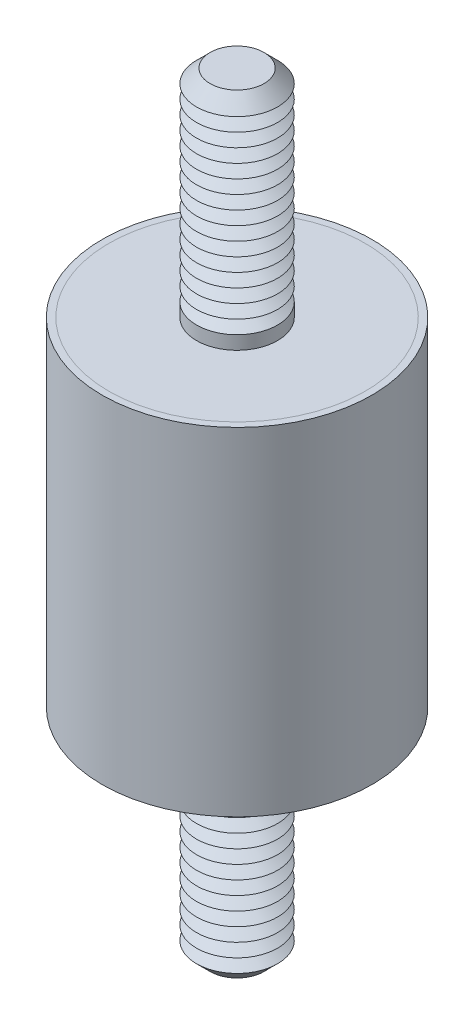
ISO-10303-21;
HEADER;
FILE_DESCRIPTION(('STEP AP214'),'2;1');
FILE_NAME('part.step','',(''),(''),'','','');
FILE_SCHEMA(('AUTOMOTIVE_DESIGN { 1 0 10303 214 1 1 1 1 }'));
ENDSEC;
DATA;
#1=APPLICATION_CONTEXT('core data for automotive mechanical design processes');
#2=APPLICATION_PROTOCOL_DEFINITION('international standard','automotive_design',2000,#1);
#3=PRODUCT_CONTEXT('',#1,'mechanical');
#4=PRODUCT('Part','Part','',(#3));
#5=PRODUCT_RELATED_PRODUCT_CATEGORY('part','',(#4));
#6=PRODUCT_DEFINITION_FORMATION('','',#4);
#7=PRODUCT_DEFINITION_CONTEXT('part definition',#1,'design');
#8=PRODUCT_DEFINITION('design','',#6,#7);
#9=PRODUCT_DEFINITION_SHAPE('','',#8);
#10=(LENGTH_UNIT() NAMED_UNIT(*) SI_UNIT(.MILLI.,.METRE.));
#11=(NAMED_UNIT(*) PLANE_ANGLE_UNIT() SI_UNIT($,.RADIAN.));
#12=(NAMED_UNIT(*) SI_UNIT($,.STERADIAN.) SOLID_ANGLE_UNIT());
#13=UNCERTAINTY_MEASURE_WITH_UNIT(LENGTH_MEASURE(1.E-05),#10,'distance_accuracy_value','');
#14=(GEOMETRIC_REPRESENTATION_CONTEXT(3) GLOBAL_UNCERTAINTY_ASSIGNED_CONTEXT((#13)) GLOBAL_UNIT_ASSIGNED_CONTEXT((#10,
#11,#12)) REPRESENTATION_CONTEXT('',''));
#15=CARTESIAN_POINT('',(0.,0.,0.));
#16=DIRECTION('',(0.,0.,1.));
#17=DIRECTION('',(1.,0.,0.));
#18=AXIS2_PLACEMENT_3D('',#15,#16,#17);
#19=CARTESIAN_POINT('',(0.,-28.5,0.));
#20=DIRECTION('',(0.,1.,0.));
#21=DIRECTION('',(0.,0.,1.));
#22=AXIS2_PLACEMENT_3D('',#19,#20,#21);
#23=CYLINDRICAL_SURFACE('',#22,3.);
#24=CARTESIAN_POINT('',(0.,-12.5,0.));
#25=DIRECTION('',(0.,-1.,0.));
#26=DIRECTION('',(0.,0.,-1.));
#27=AXIS2_PLACEMENT_3D('',#24,#25,#26);
#28=CIRCLE('',#27,3.);
#29=CARTESIAN_POINT('',(0.,-12.5,-3.));
#30=VERTEX_POINT('',#29);
#31=EDGE_CURVE('P0_E21',#30,#30,#28,.T.);
#32=ORIENTED_EDGE('',*,*,#31,.T.);
#33=EDGE_LOOP('',(#32));
#34=FACE_BOUND('',#33,.T.);
#35=CARTESIAN_POINT('',(0.,-13.5,0.));
#36=DIRECTION('',(0.,1.,0.));
#37=DIRECTION('',(0.,0.,1.));
#38=AXIS2_PLACEMENT_3D('',#35,#36,#37);
#39=CIRCLE('',#38,3.);
#40=CARTESIAN_POINT('',(0.,-13.5,3.));
#41=VERTEX_POINT('',#40);
#42=EDGE_CURVE('P0_E33',#41,#41,#39,.T.);
#43=ORIENTED_EDGE('',*,*,#42,.T.);
#44=EDGE_LOOP('',(#43));
#45=FACE_BOUND('',#44,.T.);
#46=ADVANCED_FACE('P0_F14',(#34,#45),#23,.T.);
#47=CARTESIAN_POINT('',(0.,-12.5,0.));
#48=DIRECTION('',(0.,1.,0.));
#49=DIRECTION('',(0.,0.,1.));
#50=AXIS2_PLACEMENT_3D('',#47,#48,#49);
#51=CYLINDRICAL_SURFACE('',#50,9.5);
#52=CARTESIAN_POINT('',(0.,-12.5,0.));
#53=DIRECTION('',(0.,1.,0.));
#54=DIRECTION('',(0.,0.,1.));
#55=AXIS2_PLACEMENT_3D('',#52,#53,#54);
#56=CIRCLE('',#55,9.5);
#57=CARTESIAN_POINT('',(0.,-12.5,9.5));
#58=VERTEX_POINT('',#57);
#59=EDGE_CURVE('P0_E25',#58,#58,#56,.T.);
#60=ORIENTED_EDGE('',*,*,#59,.T.);
#61=EDGE_LOOP('',(#60));
#62=FACE_BOUND('',#61,.T.);
#63=CARTESIAN_POINT('',(0.,-11.5,0.));
#64=DIRECTION('',(0.,1.,0.));
#65=DIRECTION('',(0.,0.,1.));
#66=AXIS2_PLACEMENT_3D('',#63,#64,#65);
#67=CIRCLE('',#66,9.5);
#68=CARTESIAN_POINT('',(0.,-11.5,9.5));
#69=VERTEX_POINT('',#68);
#70=EDGE_CURVE('P0_E30',#69,#69,#67,.T.);
#71=ORIENTED_EDGE('',*,*,#70,.F.);
#72=EDGE_LOOP('',(#71));
#73=FACE_BOUND('',#72,.T.);
#74=ADVANCED_FACE('P0_F145',(#62,#73),#51,.T.);
#75=CARTESIAN_POINT('',(0.,-12.5,0.));
#76=DIRECTION('',(0.,1.,0.));
#77=DIRECTION('',(0.,0.,1.));
#78=AXIS2_PLACEMENT_3D('',#75,#76,#77);
#79=PLANE('',#78);
#80=ORIENTED_EDGE('',*,*,#31,.F.);
#81=EDGE_LOOP('',(#80));
#82=FACE_BOUND('',#81,.T.);
#83=ORIENTED_EDGE('',*,*,#59,.F.);
#84=EDGE_LOOP('',(#83));
#85=FACE_BOUND('',#84,.T.);
#86=ADVANCED_FACE('P0_F150',(#82,#85),#79,.F.);
#87=CARTESIAN_POINT('',(0.,-11.5,0.));
#88=DIRECTION('',(0.,1.,0.));
#89=DIRECTION('',(0.,0.,1.));
#90=AXIS2_PLACEMENT_3D('',#87,#88,#89);
#91=PLANE('',#90);
#92=ORIENTED_EDGE('',*,*,#70,.T.);
#93=EDGE_LOOP('',(#92));
#94=FACE_BOUND('',#93,.T.);
#95=ADVANCED_FACE('P0_F156',(#94),#91,.T.);
#96=CARTESIAN_POINT('',(0.,-13.5,0.));
#97=DIRECTION('',(0.,1.,0.));
#98=DIRECTION('',(0.,0.,1.));
#99=AXIS2_PLACEMENT_3D('',#96,#97,#98);
#100=CONICAL_SURFACE('',#99,3.,1.0471975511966);
#101=CARTESIAN_POINT('',(0.,-14.,0.));
#102=DIRECTION('',(0.,1.,0.));
#103=DIRECTION('',(0.,0.,1.));
#104=AXIS2_PLACEMENT_3D('',#101,#102,#103);
#105=CIRCLE('',#104,2.13397459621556);
#106=CARTESIAN_POINT('',(0.,-14.,2.13397459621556));
#107=VERTEX_POINT('',#106);
#108=EDGE_CURVE('P0_E39',#107,#107,#105,.T.);
#109=ORIENTED_EDGE('',*,*,#108,.T.);
#110=EDGE_LOOP('',(#109));
#111=FACE_BOUND('',#110,.T.);
#112=ORIENTED_EDGE('',*,*,#42,.F.);
#113=EDGE_LOOP('',(#112));
#114=FACE_BOUND('',#113,.T.);
#115=ADVANCED_FACE('P0_F159',(#111,#114),#100,.T.);
#116=CARTESIAN_POINT('',(0.,-14.,0.));
#117=DIRECTION('',(0.,-1.,0.));
#118=DIRECTION('',(0.,0.,-1.));
#119=AXIS2_PLACEMENT_3D('',#116,#117,#118);
#120=CONICAL_SURFACE('',#119,2.13397459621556,1.0471975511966);
#121=CARTESIAN_POINT('',(0.,-14.5,0.));
#122=DIRECTION('',(0.,1.,0.));
#123=DIRECTION('',(0.,0.,1.));
#124=AXIS2_PLACEMENT_3D('',#121,#122,#123);
#125=CIRCLE('',#124,3.);
#126=CARTESIAN_POINT('',(0.,-14.5,3.));
#127=VERTEX_POINT('',#126);
#128=EDGE_CURVE('P0_E43',#127,#127,#125,.T.);
#129=ORIENTED_EDGE('',*,*,#128,.T.);
#130=EDGE_LOOP('',(#129));
#131=FACE_BOUND('',#130,.T.);
#132=ORIENTED_EDGE('',*,*,#108,.F.);
#133=EDGE_LOOP('',(#132));
#134=FACE_BOUND('',#133,.T.);
#135=ADVANCED_FACE('P0_F163',(#131,#134),#120,.T.);
#136=CARTESIAN_POINT('',(0.,-14.5,0.));
#137=DIRECTION('',(0.,1.,0.));
#138=DIRECTION('',(0.,0.,1.));
#139=AXIS2_PLACEMENT_3D('',#136,#137,#138);
#140=CONICAL_SURFACE('',#139,3.,1.0471975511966);
#141=CARTESIAN_POINT('',(0.,-15.,0.));
#142=DIRECTION('',(0.,1.,0.));
#143=DIRECTION('',(0.,0.,1.));
#144=AXIS2_PLACEMENT_3D('',#141,#142,#143);
#145=CIRCLE('',#144,2.13397459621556);
#146=CARTESIAN_POINT('',(0.,-15.,2.13397459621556));
#147=VERTEX_POINT('',#146);
#148=EDGE_CURVE('P0_E47',#147,#147,#145,.T.);
#149=ORIENTED_EDGE('',*,*,#148,.T.);
#150=EDGE_LOOP('',(#149));
#151=FACE_BOUND('',#150,.T.);
#152=ORIENTED_EDGE('',*,*,#128,.F.);
#153=EDGE_LOOP('',(#152));
#154=FACE_BOUND('',#153,.T.);
#155=ADVANCED_FACE('P0_F167',(#151,#154),#140,.T.);
#156=CARTESIAN_POINT('',(0.,-15.,0.));
#157=DIRECTION('',(0.,-1.,0.));
#158=DIRECTION('',(0.,0.,-1.));
#159=AXIS2_PLACEMENT_3D('',#156,#157,#158);
#160=CONICAL_SURFACE('',#159,2.13397459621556,1.0471975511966);
#161=CARTESIAN_POINT('',(0.,-15.5,0.));
#162=DIRECTION('',(0.,1.,0.));
#163=DIRECTION('',(0.,0.,1.));
#164=AXIS2_PLACEMENT_3D('',#161,#162,#163);
#165=CIRCLE('',#164,3.);
#166=CARTESIAN_POINT('',(0.,-15.5,3.));
#167=VERTEX_POINT('',#166);
#168=EDGE_CURVE('P0_E52',#167,#167,#165,.T.);
#169=ORIENTED_EDGE('',*,*,#168,.T.);
#170=EDGE_LOOP('',(#169));
#171=FACE_BOUND('',#170,.T.);
#172=ORIENTED_EDGE('',*,*,#148,.F.);
#173=EDGE_LOOP('',(#172));
#174=FACE_BOUND('',#173,.T.);
#175=ADVANCED_FACE('P0_F174',(#171,#174),#160,.T.);
#176=CARTESIAN_POINT('',(0.,-15.5,0.));
#177=DIRECTION('',(0.,1.,0.));
#178=DIRECTION('',(0.,0.,1.));
#179=AXIS2_PLACEMENT_3D('',#176,#177,#178);
#180=CONICAL_SURFACE('',#179,3.,1.0471975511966);
#181=CARTESIAN_POINT('',(0.,-16.,0.));
#182=DIRECTION('',(0.,1.,0.));
#183=DIRECTION('',(0.,0.,1.));
#184=AXIS2_PLACEMENT_3D('',#181,#182,#183);
#185=CIRCLE('',#184,2.13397459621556);
#186=CARTESIAN_POINT('',(0.,-16.,2.13397459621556));
#187=VERTEX_POINT('',#186);
#188=EDGE_CURVE('P0_E55',#187,#187,#185,.T.);
#189=ORIENTED_EDGE('',*,*,#188,.T.);
#190=EDGE_LOOP('',(#189));
#191=FACE_BOUND('',#190,.T.);
#192=ORIENTED_EDGE('',*,*,#168,.F.);
#193=EDGE_LOOP('',(#192));
#194=FACE_BOUND('',#193,.T.);
#195=ADVANCED_FACE('P0_F178',(#191,#194),#180,.T.);
#196=CARTESIAN_POINT('',(0.,-16.,0.));
#197=DIRECTION('',(0.,-1.,0.));
#198=DIRECTION('',(0.,0.,-1.));
#199=AXIS2_PLACEMENT_3D('',#196,#197,#198);
#200=CONICAL_SURFACE('',#199,2.13397459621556,1.0471975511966);
#201=CARTESIAN_POINT('',(0.,-16.5,0.));
#202=DIRECTION('',(0.,1.,0.));
#203=DIRECTION('',(0.,0.,1.));
#204=AXIS2_PLACEMENT_3D('',#201,#202,#203);
#205=CIRCLE('',#204,3.);
#206=CARTESIAN_POINT('',(0.,-16.5,3.));
#207=VERTEX_POINT('',#206);
#208=EDGE_CURVE('P0_E58',#207,#207,#205,.T.);
#209=ORIENTED_EDGE('',*,*,#208,.T.);
#210=EDGE_LOOP('',(#209));
#211=FACE_BOUND('',#210,.T.);
#212=ORIENTED_EDGE('',*,*,#188,.F.);
#213=EDGE_LOOP('',(#212));
#214=FACE_BOUND('',#213,.T.);
#215=ADVANCED_FACE('P0_F182',(#211,#214),#200,.T.);
#216=CARTESIAN_POINT('',(0.,-16.5,0.));
#217=DIRECTION('',(0.,1.,0.));
#218=DIRECTION('',(0.,0.,1.));
#219=AXIS2_PLACEMENT_3D('',#216,#217,#218);
#220=CONICAL_SURFACE('',#219,3.,1.0471975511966);
#221=CARTESIAN_POINT('',(0.,-17.,0.));
#222=DIRECTION('',(0.,1.,0.));
#223=DIRECTION('',(0.,0.,1.));
#224=AXIS2_PLACEMENT_3D('',#221,#222,#223);
#225=CIRCLE('',#224,2.13397459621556);
#226=CARTESIAN_POINT('',(0.,-17.,2.13397459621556));
#227=VERTEX_POINT('',#226);
#228=EDGE_CURVE('P0_E61',#227,#227,#225,.T.);
#229=ORIENTED_EDGE('',*,*,#228,.T.);
#230=EDGE_LOOP('',(#229));
#231=FACE_BOUND('',#230,.T.);
#232=ORIENTED_EDGE('',*,*,#208,.F.);
#233=EDGE_LOOP('',(#232));
#234=FACE_BOUND('',#233,.T.);
#235=ADVANCED_FACE('P0_F186',(#231,#234),#220,.T.);
#236=CARTESIAN_POINT('',(0.,-17.,0.));
#237=DIRECTION('',(0.,-1.,0.));
#238=DIRECTION('',(0.,0.,-1.));
#239=AXIS2_PLACEMENT_3D('',#236,#237,#238);
#240=CONICAL_SURFACE('',#239,2.13397459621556,1.0471975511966);
#241=CARTESIAN_POINT('',(0.,-17.5,0.));
#242=DIRECTION('',(0.,1.,0.));
#243=DIRECTION('',(0.,0.,1.));
#244=AXIS2_PLACEMENT_3D('',#241,#242,#243);
#245=CIRCLE('',#244,3.);
#246=CARTESIAN_POINT('',(0.,-17.5,3.));
#247=VERTEX_POINT('',#246);
#248=EDGE_CURVE('P0_E64',#247,#247,#245,.T.);
#249=ORIENTED_EDGE('',*,*,#248,.T.);
#250=EDGE_LOOP('',(#249));
#251=FACE_BOUND('',#250,.T.);
#252=ORIENTED_EDGE('',*,*,#228,.F.);
#253=EDGE_LOOP('',(#252));
#254=FACE_BOUND('',#253,.T.);
#255=ADVANCED_FACE('P0_F190',(#251,#254),#240,.T.);
#256=CARTESIAN_POINT('',(0.,-17.5,0.));
#257=DIRECTION('',(0.,1.,0.));
#258=DIRECTION('',(0.,0.,1.));
#259=AXIS2_PLACEMENT_3D('',#256,#257,#258);
#260=CONICAL_SURFACE('',#259,3.,1.0471975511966);
#261=CARTESIAN_POINT('',(0.,-18.,0.));
#262=DIRECTION('',(0.,1.,0.));
#263=DIRECTION('',(0.,0.,1.));
#264=AXIS2_PLACEMENT_3D('',#261,#262,#263);
#265=CIRCLE('',#264,2.13397459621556);
#266=CARTESIAN_POINT('',(0.,-18.,2.13397459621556));
#267=VERTEX_POINT('',#266);
#268=EDGE_CURVE('P0_E67',#267,#267,#265,.T.);
#269=ORIENTED_EDGE('',*,*,#268,.T.);
#270=EDGE_LOOP('',(#269));
#271=FACE_BOUND('',#270,.T.);
#272=ORIENTED_EDGE('',*,*,#248,.F.);
#273=EDGE_LOOP('',(#272));
#274=FACE_BOUND('',#273,.T.);
#275=ADVANCED_FACE('P0_F194',(#271,#274),#260,.T.);
#276=CARTESIAN_POINT('',(0.,-18.,0.));
#277=DIRECTION('',(0.,-1.,0.));
#278=DIRECTION('',(0.,0.,-1.));
#279=AXIS2_PLACEMENT_3D('',#276,#277,#278);
#280=CONICAL_SURFACE('',#279,2.13397459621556,1.0471975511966);
#281=CARTESIAN_POINT('',(0.,-18.5,0.));
#282=DIRECTION('',(0.,1.,0.));
#283=DIRECTION('',(0.,0.,1.));
#284=AXIS2_PLACEMENT_3D('',#281,#282,#283);
#285=CIRCLE('',#284,3.);
#286=CARTESIAN_POINT('',(0.,-18.5,3.));
#287=VERTEX_POINT('',#286);
#288=EDGE_CURVE('P0_E70',#287,#287,#285,.T.);
#289=ORIENTED_EDGE('',*,*,#288,.T.);
#290=EDGE_LOOP('',(#289));
#291=FACE_BOUND('',#290,.T.);
#292=ORIENTED_EDGE('',*,*,#268,.F.);
#293=EDGE_LOOP('',(#292));
#294=FACE_BOUND('',#293,.T.);
#295=ADVANCED_FACE('P0_F198',(#291,#294),#280,.T.);
#296=CARTESIAN_POINT('',(0.,-18.5,0.));
#297=DIRECTION('',(0.,1.,0.));
#298=DIRECTION('',(0.,0.,1.));
#299=AXIS2_PLACEMENT_3D('',#296,#297,#298);
#300=CONICAL_SURFACE('',#299,3.,1.0471975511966);
#301=CARTESIAN_POINT('',(0.,-19.,0.));
#302=DIRECTION('',(0.,1.,0.));
#303=DIRECTION('',(0.,0.,1.));
#304=AXIS2_PLACEMENT_3D('',#301,#302,#303);
#305=CIRCLE('',#304,2.13397459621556);
#306=CARTESIAN_POINT('',(0.,-19.,2.13397459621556));
#307=VERTEX_POINT('',#306);
#308=EDGE_CURVE('P0_E73',#307,#307,#305,.T.);
#309=ORIENTED_EDGE('',*,*,#308,.T.);
#310=EDGE_LOOP('',(#309));
#311=FACE_BOUND('',#310,.T.);
#312=ORIENTED_EDGE('',*,*,#288,.F.);
#313=EDGE_LOOP('',(#312));
#314=FACE_BOUND('',#313,.T.);
#315=ADVANCED_FACE('P0_F202',(#311,#314),#300,.T.);
#316=CARTESIAN_POINT('',(0.,-19.,0.));
#317=DIRECTION('',(0.,-1.,0.));
#318=DIRECTION('',(0.,0.,-1.));
#319=AXIS2_PLACEMENT_3D('',#316,#317,#318);
#320=CONICAL_SURFACE('',#319,2.13397459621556,1.0471975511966);
#321=CARTESIAN_POINT('',(0.,-19.5,0.));
#322=DIRECTION('',(0.,1.,0.));
#323=DIRECTION('',(0.,0.,1.));
#324=AXIS2_PLACEMENT_3D('',#321,#322,#323);
#325=CIRCLE('',#324,3.);
#326=CARTESIAN_POINT('',(0.,-19.5,3.));
#327=VERTEX_POINT('',#326);
#328=EDGE_CURVE('P0_E76',#327,#327,#325,.T.);
#329=ORIENTED_EDGE('',*,*,#328,.T.);
#330=EDGE_LOOP('',(#329));
#331=FACE_BOUND('',#330,.T.);
#332=ORIENTED_EDGE('',*,*,#308,.F.);
#333=EDGE_LOOP('',(#332));
#334=FACE_BOUND('',#333,.T.);
#335=ADVANCED_FACE('P0_F206',(#331,#334),#320,.T.);
#336=CARTESIAN_POINT('',(0.,-19.5,0.));
#337=DIRECTION('',(0.,1.,0.));
#338=DIRECTION('',(0.,0.,1.));
#339=AXIS2_PLACEMENT_3D('',#336,#337,#338);
#340=CONICAL_SURFACE('',#339,3.,1.0471975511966);
#341=CARTESIAN_POINT('',(0.,-20.,0.));
#342=DIRECTION('',(0.,1.,0.));
#343=DIRECTION('',(0.,0.,1.));
#344=AXIS2_PLACEMENT_3D('',#341,#342,#343);
#345=CIRCLE('',#344,2.13397459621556);
#346=CARTESIAN_POINT('',(0.,-20.,2.13397459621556));
#347=VERTEX_POINT('',#346);
#348=EDGE_CURVE('P0_E79',#347,#347,#345,.T.);
#349=ORIENTED_EDGE('',*,*,#348,.T.);
#350=EDGE_LOOP('',(#349));
#351=FACE_BOUND('',#350,.T.);
#352=ORIENTED_EDGE('',*,*,#328,.F.);
#353=EDGE_LOOP('',(#352));
#354=FACE_BOUND('',#353,.T.);
#355=ADVANCED_FACE('P0_F210',(#351,#354),#340,.T.);
#356=CARTESIAN_POINT('',(0.,-20.,0.));
#357=DIRECTION('',(0.,-1.,0.));
#358=DIRECTION('',(0.,0.,-1.));
#359=AXIS2_PLACEMENT_3D('',#356,#357,#358);
#360=CONICAL_SURFACE('',#359,2.13397459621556,1.0471975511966);
#361=CARTESIAN_POINT('',(0.,-20.5,0.));
#362=DIRECTION('',(0.,1.,0.));
#363=DIRECTION('',(0.,0.,1.));
#364=AXIS2_PLACEMENT_3D('',#361,#362,#363);
#365=CIRCLE('',#364,3.);
#366=CARTESIAN_POINT('',(0.,-20.5,3.));
#367=VERTEX_POINT('',#366);
#368=EDGE_CURVE('P0_E82',#367,#367,#365,.T.);
#369=ORIENTED_EDGE('',*,*,#368,.T.);
#370=EDGE_LOOP('',(#369));
#371=FACE_BOUND('',#370,.T.);
#372=ORIENTED_EDGE('',*,*,#348,.F.);
#373=EDGE_LOOP('',(#372));
#374=FACE_BOUND('',#373,.T.);
#375=ADVANCED_FACE('P0_F214',(#371,#374),#360,.T.);
#376=CARTESIAN_POINT('',(0.,-20.5,0.));
#377=DIRECTION('',(0.,1.,0.));
#378=DIRECTION('',(0.,0.,1.));
#379=AXIS2_PLACEMENT_3D('',#376,#377,#378);
#380=CONICAL_SURFACE('',#379,3.,1.0471975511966);
#381=CARTESIAN_POINT('',(0.,-21.,0.));
#382=DIRECTION('',(0.,1.,0.));
#383=DIRECTION('',(0.,0.,1.));
#384=AXIS2_PLACEMENT_3D('',#381,#382,#383);
#385=CIRCLE('',#384,2.13397459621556);
#386=CARTESIAN_POINT('',(0.,-21.,2.13397459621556));
#387=VERTEX_POINT('',#386);
#388=EDGE_CURVE('P0_E85',#387,#387,#385,.T.);
#389=ORIENTED_EDGE('',*,*,#388,.T.);
#390=EDGE_LOOP('',(#389));
#391=FACE_BOUND('',#390,.T.);
#392=ORIENTED_EDGE('',*,*,#368,.F.);
#393=EDGE_LOOP('',(#392));
#394=FACE_BOUND('',#393,.T.);
#395=ADVANCED_FACE('P0_F218',(#391,#394),#380,.T.);
#396=CARTESIAN_POINT('',(0.,-21.,0.));
#397=DIRECTION('',(0.,-1.,0.));
#398=DIRECTION('',(0.,0.,-1.));
#399=AXIS2_PLACEMENT_3D('',#396,#397,#398);
#400=CONICAL_SURFACE('',#399,2.13397459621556,1.0471975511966);
#401=CARTESIAN_POINT('',(0.,-21.5,0.));
#402=DIRECTION('',(0.,1.,0.));
#403=DIRECTION('',(0.,0.,1.));
#404=AXIS2_PLACEMENT_3D('',#401,#402,#403);
#405=CIRCLE('',#404,3.);
#406=CARTESIAN_POINT('',(0.,-21.5,3.));
#407=VERTEX_POINT('',#406);
#408=EDGE_CURVE('P0_E88',#407,#407,#405,.T.);
#409=ORIENTED_EDGE('',*,*,#408,.T.);
#410=EDGE_LOOP('',(#409));
#411=FACE_BOUND('',#410,.T.);
#412=ORIENTED_EDGE('',*,*,#388,.F.);
#413=EDGE_LOOP('',(#412));
#414=FACE_BOUND('',#413,.T.);
#415=ADVANCED_FACE('P0_F222',(#411,#414),#400,.T.);
#416=CARTESIAN_POINT('',(0.,-21.5,0.));
#417=DIRECTION('',(0.,1.,0.));
#418=DIRECTION('',(0.,0.,1.));
#419=AXIS2_PLACEMENT_3D('',#416,#417,#418);
#420=CONICAL_SURFACE('',#419,3.,1.0471975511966);
#421=CARTESIAN_POINT('',(0.,-22.,0.));
#422=DIRECTION('',(0.,1.,0.));
#423=DIRECTION('',(0.,0.,1.));
#424=AXIS2_PLACEMENT_3D('',#421,#422,#423);
#425=CIRCLE('',#424,2.13397459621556);
#426=CARTESIAN_POINT('',(0.,-22.,2.13397459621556));
#427=VERTEX_POINT('',#426);
#428=EDGE_CURVE('P0_E91',#427,#427,#425,.T.);
#429=ORIENTED_EDGE('',*,*,#428,.T.);
#430=EDGE_LOOP('',(#429));
#431=FACE_BOUND('',#430,.T.);
#432=ORIENTED_EDGE('',*,*,#408,.F.);
#433=EDGE_LOOP('',(#432));
#434=FACE_BOUND('',#433,.T.);
#435=ADVANCED_FACE('P0_F226',(#431,#434),#420,.T.);
#436=CARTESIAN_POINT('',(0.,-22.,0.));
#437=DIRECTION('',(0.,-1.,0.));
#438=DIRECTION('',(0.,0.,-1.));
#439=AXIS2_PLACEMENT_3D('',#436,#437,#438);
#440=CONICAL_SURFACE('',#439,2.13397459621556,1.0471975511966);
#441=CARTESIAN_POINT('',(0.,-22.5,0.));
#442=DIRECTION('',(0.,1.,0.));
#443=DIRECTION('',(0.,0.,1.));
#444=AXIS2_PLACEMENT_3D('',#441,#442,#443);
#445=CIRCLE('',#444,3.);
#446=CARTESIAN_POINT('',(0.,-22.5,3.));
#447=VERTEX_POINT('',#446);
#448=EDGE_CURVE('P0_E94',#447,#447,#445,.T.);
#449=ORIENTED_EDGE('',*,*,#448,.T.);
#450=EDGE_LOOP('',(#449));
#451=FACE_BOUND('',#450,.T.);
#452=ORIENTED_EDGE('',*,*,#428,.F.);
#453=EDGE_LOOP('',(#452));
#454=FACE_BOUND('',#453,.T.);
#455=ADVANCED_FACE('P0_F230',(#451,#454),#440,.T.);
#456=CARTESIAN_POINT('',(0.,-22.5,0.));
#457=DIRECTION('',(0.,1.,0.));
#458=DIRECTION('',(0.,0.,1.));
#459=AXIS2_PLACEMENT_3D('',#456,#457,#458);
#460=CONICAL_SURFACE('',#459,3.,1.0471975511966);
#461=CARTESIAN_POINT('',(0.,-23.,0.));
#462=DIRECTION('',(0.,1.,0.));
#463=DIRECTION('',(0.,0.,1.));
#464=AXIS2_PLACEMENT_3D('',#461,#462,#463);
#465=CIRCLE('',#464,2.13397459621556);
#466=CARTESIAN_POINT('',(0.,-23.,2.13397459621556));
#467=VERTEX_POINT('',#466);
#468=EDGE_CURVE('P0_E97',#467,#467,#465,.T.);
#469=ORIENTED_EDGE('',*,*,#468,.T.);
#470=EDGE_LOOP('',(#469));
#471=FACE_BOUND('',#470,.T.);
#472=ORIENTED_EDGE('',*,*,#448,.F.);
#473=EDGE_LOOP('',(#472));
#474=FACE_BOUND('',#473,.T.);
#475=ADVANCED_FACE('P0_F234',(#471,#474),#460,.T.);
#476=CARTESIAN_POINT('',(0.,-23.,0.));
#477=DIRECTION('',(0.,-1.,0.));
#478=DIRECTION('',(0.,0.,-1.));
#479=AXIS2_PLACEMENT_3D('',#476,#477,#478);
#480=CONICAL_SURFACE('',#479,2.13397459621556,1.0471975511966);
#481=CARTESIAN_POINT('',(0.,-23.5,0.));
#482=DIRECTION('',(0.,1.,0.));
#483=DIRECTION('',(0.,0.,1.));
#484=AXIS2_PLACEMENT_3D('',#481,#482,#483);
#485=CIRCLE('',#484,3.);
#486=CARTESIAN_POINT('',(0.,-23.5,3.));
#487=VERTEX_POINT('',#486);
#488=EDGE_CURVE('P0_E100',#487,#487,#485,.T.);
#489=ORIENTED_EDGE('',*,*,#488,.T.);
#490=EDGE_LOOP('',(#489));
#491=FACE_BOUND('',#490,.T.);
#492=ORIENTED_EDGE('',*,*,#468,.F.);
#493=EDGE_LOOP('',(#492));
#494=FACE_BOUND('',#493,.T.);
#495=ADVANCED_FACE('P0_F238',(#491,#494),#480,.T.);
#496=CARTESIAN_POINT('',(0.,-23.5,0.));
#497=DIRECTION('',(0.,1.,0.));
#498=DIRECTION('',(0.,0.,1.));
#499=AXIS2_PLACEMENT_3D('',#496,#497,#498);
#500=CONICAL_SURFACE('',#499,3.,1.0471975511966);
#501=CARTESIAN_POINT('',(0.,-24.,0.));
#502=DIRECTION('',(0.,1.,0.));
#503=DIRECTION('',(0.,0.,1.));
#504=AXIS2_PLACEMENT_3D('',#501,#502,#503);
#505=CIRCLE('',#504,2.13397459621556);
#506=CARTESIAN_POINT('',(0.,-24.,2.13397459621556));
#507=VERTEX_POINT('',#506);
#508=EDGE_CURVE('P0_E103',#507,#507,#505,.T.);
#509=ORIENTED_EDGE('',*,*,#508,.T.);
#510=EDGE_LOOP('',(#509));
#511=FACE_BOUND('',#510,.T.);
#512=ORIENTED_EDGE('',*,*,#488,.F.);
#513=EDGE_LOOP('',(#512));
#514=FACE_BOUND('',#513,.T.);
#515=ADVANCED_FACE('P0_F242',(#511,#514),#500,.T.);
#516=CARTESIAN_POINT('',(0.,-24.,0.));
#517=DIRECTION('',(0.,-1.,0.));
#518=DIRECTION('',(0.,0.,-1.));
#519=AXIS2_PLACEMENT_3D('',#516,#517,#518);
#520=CONICAL_SURFACE('',#519,2.13397459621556,1.0471975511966);
#521=CARTESIAN_POINT('',(0.,-24.5,0.));
#522=DIRECTION('',(0.,1.,0.));
#523=DIRECTION('',(0.,0.,1.));
#524=AXIS2_PLACEMENT_3D('',#521,#522,#523);
#525=CIRCLE('',#524,3.);
#526=CARTESIAN_POINT('',(0.,-24.5,3.));
#527=VERTEX_POINT('',#526);
#528=EDGE_CURVE('P0_E106',#527,#527,#525,.T.);
#529=ORIENTED_EDGE('',*,*,#528,.T.);
#530=EDGE_LOOP('',(#529));
#531=FACE_BOUND('',#530,.T.);
#532=ORIENTED_EDGE('',*,*,#508,.F.);
#533=EDGE_LOOP('',(#532));
#534=FACE_BOUND('',#533,.T.);
#535=ADVANCED_FACE('P0_F246',(#531,#534),#520,.T.);
#536=CARTESIAN_POINT('',(0.,-24.5,0.));
#537=DIRECTION('',(0.,1.,0.));
#538=DIRECTION('',(0.,0.,1.));
#539=AXIS2_PLACEMENT_3D('',#536,#537,#538);
#540=CONICAL_SURFACE('',#539,3.,1.0471975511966);
#541=CARTESIAN_POINT('',(0.,-25.,0.));
#542=DIRECTION('',(0.,1.,0.));
#543=DIRECTION('',(0.,0.,1.));
#544=AXIS2_PLACEMENT_3D('',#541,#542,#543);
#545=CIRCLE('',#544,2.13397459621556);
#546=CARTESIAN_POINT('',(0.,-25.,2.13397459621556));
#547=VERTEX_POINT('',#546);
#548=EDGE_CURVE('P0_E109',#547,#547,#545,.T.);
#549=ORIENTED_EDGE('',*,*,#548,.T.);
#550=EDGE_LOOP('',(#549));
#551=FACE_BOUND('',#550,.T.);
#552=ORIENTED_EDGE('',*,*,#528,.F.);
#553=EDGE_LOOP('',(#552));
#554=FACE_BOUND('',#553,.T.);
#555=ADVANCED_FACE('P0_F250',(#551,#554),#540,.T.);
#556=CARTESIAN_POINT('',(0.,-25.,0.));
#557=DIRECTION('',(0.,-1.,0.));
#558=DIRECTION('',(0.,0.,-1.));
#559=AXIS2_PLACEMENT_3D('',#556,#557,#558);
#560=CONICAL_SURFACE('',#559,2.13397459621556,1.0471975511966);
#561=CARTESIAN_POINT('',(0.,-25.5,0.));
#562=DIRECTION('',(0.,1.,0.));
#563=DIRECTION('',(0.,0.,1.));
#564=AXIS2_PLACEMENT_3D('',#561,#562,#563);
#565=CIRCLE('',#564,3.);
#566=CARTESIAN_POINT('',(0.,-25.5,3.));
#567=VERTEX_POINT('',#566);
#568=EDGE_CURVE('P0_E112',#567,#567,#565,.T.);
#569=ORIENTED_EDGE('',*,*,#568,.T.);
#570=EDGE_LOOP('',(#569));
#571=FACE_BOUND('',#570,.T.);
#572=ORIENTED_EDGE('',*,*,#548,.F.);
#573=EDGE_LOOP('',(#572));
#574=FACE_BOUND('',#573,.T.);
#575=ADVANCED_FACE('P0_F254',(#571,#574),#560,.T.);
#576=CARTESIAN_POINT('',(0.,-25.5,0.));
#577=DIRECTION('',(0.,1.,0.));
#578=DIRECTION('',(0.,0.,1.));
#579=AXIS2_PLACEMENT_3D('',#576,#577,#578);
#580=CONICAL_SURFACE('',#579,3.,1.0471975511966);
#581=CARTESIAN_POINT('',(0.,-26.,0.));
#582=DIRECTION('',(0.,1.,0.));
#583=DIRECTION('',(0.,0.,1.));
#584=AXIS2_PLACEMENT_3D('',#581,#582,#583);
#585=CIRCLE('',#584,2.13397459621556);
#586=CARTESIAN_POINT('',(0.,-26.,2.13397459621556));
#587=VERTEX_POINT('',#586);
#588=EDGE_CURVE('P0_E115',#587,#587,#585,.T.);
#589=ORIENTED_EDGE('',*,*,#588,.T.);
#590=EDGE_LOOP('',(#589));
#591=FACE_BOUND('',#590,.T.);
#592=ORIENTED_EDGE('',*,*,#568,.F.);
#593=EDGE_LOOP('',(#592));
#594=FACE_BOUND('',#593,.T.);
#595=ADVANCED_FACE('P0_F258',(#591,#594),#580,.T.);
#596=CARTESIAN_POINT('',(0.,-26.,0.));
#597=DIRECTION('',(0.,-1.,0.));
#598=DIRECTION('',(0.,0.,-1.));
#599=AXIS2_PLACEMENT_3D('',#596,#597,#598);
#600=CONICAL_SURFACE('',#599,2.13397459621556,1.0471975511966);
#601=CARTESIAN_POINT('',(0.,-26.5,0.));
#602=DIRECTION('',(0.,1.,0.));
#603=DIRECTION('',(0.,0.,1.));
#604=AXIS2_PLACEMENT_3D('',#601,#602,#603);
#605=CIRCLE('',#604,3.);
#606=CARTESIAN_POINT('',(0.,-26.5,3.));
#607=VERTEX_POINT('',#606);
#608=EDGE_CURVE('P0_E118',#607,#607,#605,.T.);
#609=ORIENTED_EDGE('',*,*,#608,.T.);
#610=EDGE_LOOP('',(#609));
#611=FACE_BOUND('',#610,.T.);
#612=ORIENTED_EDGE('',*,*,#588,.F.);
#613=EDGE_LOOP('',(#612));
#614=FACE_BOUND('',#613,.T.);
#615=ADVANCED_FACE('P0_F142',(#611,#614),#600,.T.);
#616=CARTESIAN_POINT('',(0.,-26.5,0.));
#617=DIRECTION('',(0.,1.,0.));
#618=DIRECTION('',(0.,0.,1.));
#619=AXIS2_PLACEMENT_3D('',#616,#617,#618);
#620=CONICAL_SURFACE('',#619,3.,1.0471975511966);
#621=CARTESIAN_POINT('',(0.,-27.,0.));
#622=DIRECTION('',(0.,1.,0.));
#623=DIRECTION('',(0.,0.,1.));
#624=AXIS2_PLACEMENT_3D('',#621,#622,#623);
#625=CIRCLE('',#624,2.13397459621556);
#626=CARTESIAN_POINT('',(0.,-27.,2.13397459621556));
#627=VERTEX_POINT('',#626);
#628=EDGE_CURVE('P0_E124',#627,#627,#625,.T.);
#629=ORIENTED_EDGE('',*,*,#628,.T.);
#630=EDGE_LOOP('',(#629));
#631=FACE_BOUND('',#630,.T.);
#632=ORIENTED_EDGE('',*,*,#608,.F.);
#633=EDGE_LOOP('',(#632));
#634=FACE_BOUND('',#633,.T.);
#635=ADVANCED_FACE('P0_F128',(#631,#634),#620,.T.);
#636=CARTESIAN_POINT('',(0.,-27.,0.));
#637=DIRECTION('',(0.,-1.,0.));
#638=DIRECTION('',(0.,0.,-1.));
#639=AXIS2_PLACEMENT_3D('',#636,#637,#638);
#640=CONICAL_SURFACE('',#639,2.13397459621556,1.0471975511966);
#641=CARTESIAN_POINT('',(0.,-27.5,0.));
#642=DIRECTION('',(0.,1.,0.));
#643=DIRECTION('',(0.,0.,1.));
#644=AXIS2_PLACEMENT_3D('',#641,#642,#643);
#645=CIRCLE('',#644,3.);
#646=CARTESIAN_POINT('',(0.,-27.5,3.));
#647=VERTEX_POINT('',#646);
#648=EDGE_CURVE('P0_E121',#647,#647,#645,.T.);
#649=ORIENTED_EDGE('',*,*,#648,.T.);
#650=EDGE_LOOP('',(#649));
#651=FACE_BOUND('',#650,.T.);
#652=ORIENTED_EDGE('',*,*,#628,.F.);
#653=EDGE_LOOP('',(#652));
#654=FACE_BOUND('',#653,.T.);
#655=ADVANCED_FACE('P0_F131',(#651,#654),#640,.T.);
#656=CARTESIAN_POINT('',(0.,-28.5,0.));
#657=DIRECTION('',(0.,-1.,0.));
#658=DIRECTION('',(0.,0.,-1.));
#659=AXIS2_PLACEMENT_3D('',#656,#657,#658);
#660=PLANE('',#659);
#661=CARTESIAN_POINT('',(0.,-28.5,0.));
#662=DIRECTION('',(0.,-1.,0.));
#663=DIRECTION('',(0.,0.,-1.));
#664=AXIS2_PLACEMENT_3D('',#661,#662,#663);
#665=CIRCLE('',#664,2.);
#666=CARTESIAN_POINT('',(0.,-28.5,-2.));
#667=VERTEX_POINT('',#666);
#668=EDGE_CURVE('P0_E10',#667,#667,#665,.T.);
#669=ORIENTED_EDGE('',*,*,#668,.T.);
#670=EDGE_LOOP('',(#669));
#671=FACE_BOUND('',#670,.T.);
#672=ADVANCED_FACE('P0_F133',(#671),#660,.T.);
#673=CARTESIAN_POINT('',(0.,-28.5,0.));
#674=DIRECTION('',(0.,1.,0.));
#675=DIRECTION('',(0.,0.,1.));
#676=AXIS2_PLACEMENT_3D('',#673,#674,#675);
#677=CONICAL_SURFACE('',#676,2.,0.785398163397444);
#678=ORIENTED_EDGE('',*,*,#648,.F.);
#679=EDGE_LOOP('',(#678));
#680=FACE_BOUND('',#679,.T.);
#681=ORIENTED_EDGE('',*,*,#668,.F.);
#682=EDGE_LOOP('',(#681));
#683=FACE_BOUND('',#682,.T.);
#684=ADVANCED_FACE('P0_F16',(#680,#683),#677,.T.);
#685=CLOSED_SHELL('',(#46,#74,#86,#95,#115,#135,#155,#175,#195,#215,#235,#255,#275,#295,#315,
#335,#355,#375,#395,#415,#435,#455,#475,#495,#515,#535,#555,#575,#595,#615,#635,#655,#672,#684));
#686=MANIFOLD_SOLID_BREP('P0_B1',#685);
#687=CARTESIAN_POINT('',(0.,28.5,0.));
#688=DIRECTION('',(0.,-1.,0.));
#689=DIRECTION('',(0.,0.,-1.));
#690=AXIS2_PLACEMENT_3D('',#687,#688,#689);
#691=CYLINDRICAL_SURFACE('',#690,3.);
#692=CARTESIAN_POINT('',(0.,13.5,0.));
#693=DIRECTION('',(0.,1.,0.));
#694=DIRECTION('',(0.,0.,1.));
#695=AXIS2_PLACEMENT_3D('',#692,#693,#694);
#696=CIRCLE('',#695,3.);
#697=CARTESIAN_POINT('',(0.,13.5,3.));
#698=VERTEX_POINT('',#697);
#699=EDGE_CURVE('P1_E33',#698,#698,#696,.T.);
#700=ORIENTED_EDGE('',*,*,#699,.F.);
#701=EDGE_LOOP('',(#700));
#702=FACE_BOUND('',#701,.T.);
#703=CARTESIAN_POINT('',(0.,12.5,0.));
#704=DIRECTION('',(0.,1.,0.));
#705=DIRECTION('',(0.,0.,1.));
#706=AXIS2_PLACEMENT_3D('',#703,#704,#705);
#707=CIRCLE('',#706,3.);
#708=CARTESIAN_POINT('',(0.,12.5,3.));
#709=VERTEX_POINT('',#708);
#710=EDGE_CURVE('P1_E21',#709,#709,#707,.T.);
#711=ORIENTED_EDGE('',*,*,#710,.T.);
#712=EDGE_LOOP('',(#711));
#713=FACE_BOUND('',#712,.T.);
#714=ADVANCED_FACE('P1_F14',(#702,#713),#691,.T.);
#715=CARTESIAN_POINT('',(0.,12.5,0.));
#716=DIRECTION('',(0.,-1.,0.));
#717=DIRECTION('',(0.,0.,-1.));
#718=AXIS2_PLACEMENT_3D('',#715,#716,#717);
#719=CYLINDRICAL_SURFACE('',#718,9.5);
#720=CARTESIAN_POINT('',(0.,12.5,0.));
#721=DIRECTION('',(0.,1.,0.));
#722=DIRECTION('',(0.,0.,1.));
#723=AXIS2_PLACEMENT_3D('',#720,#721,#722);
#724=CIRCLE('',#723,9.5);
#725=CARTESIAN_POINT('',(0.,12.5,9.5));
#726=VERTEX_POINT('',#725);
#727=EDGE_CURVE('P1_E25',#726,#726,#724,.T.);
#728=ORIENTED_EDGE('',*,*,#727,.F.);
#729=EDGE_LOOP('',(#728));
#730=FACE_BOUND('',#729,.T.);
#731=CARTESIAN_POINT('',(0.,11.5,0.));
#732=DIRECTION('',(0.,1.,0.));
#733=DIRECTION('',(0.,0.,1.));
#734=AXIS2_PLACEMENT_3D('',#731,#732,#733);
#735=CIRCLE('',#734,9.5);
#736=CARTESIAN_POINT('',(0.,11.5,9.5));
#737=VERTEX_POINT('',#736);
#738=EDGE_CURVE('P1_E30',#737,#737,#735,.T.);
#739=ORIENTED_EDGE('',*,*,#738,.T.);
#740=EDGE_LOOP('',(#739));
#741=FACE_BOUND('',#740,.T.);
#742=ADVANCED_FACE('P1_F292',(#730,#741),#719,.T.);
#743=CARTESIAN_POINT('',(0.,12.5,0.));
#744=DIRECTION('',(0.,1.,0.));
#745=DIRECTION('',(0.,0.,1.));
#746=AXIS2_PLACEMENT_3D('',#743,#744,#745);
#747=PLANE('',#746);
#748=ORIENTED_EDGE('',*,*,#710,.F.);
#749=EDGE_LOOP('',(#748));
#750=FACE_BOUND('',#749,.T.);
#751=ORIENTED_EDGE('',*,*,#727,.T.);
#752=EDGE_LOOP('',(#751));
#753=FACE_BOUND('',#752,.T.);
#754=ADVANCED_FACE('P1_F298',(#750,#753),#747,.T.);
#755=CARTESIAN_POINT('',(0.,11.5,0.));
#756=DIRECTION('',(0.,1.,0.));
#757=DIRECTION('',(0.,0.,1.));
#758=AXIS2_PLACEMENT_3D('',#755,#756,#757);
#759=PLANE('',#758);
#760=ORIENTED_EDGE('',*,*,#738,.F.);
#761=EDGE_LOOP('',(#760));
#762=FACE_BOUND('',#761,.T.);
#763=ADVANCED_FACE('P1_F288',(#762),#759,.F.);
#764=CARTESIAN_POINT('',(0.,13.5,0.));
#765=DIRECTION('',(0.,-1.,0.));
#766=DIRECTION('',(0.,0.,-1.));
#767=AXIS2_PLACEMENT_3D('',#764,#765,#766);
#768=CONICAL_SURFACE('',#767,3.,1.0471975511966);
#769=CARTESIAN_POINT('',(0.,14.,0.));
#770=DIRECTION('',(0.,1.,0.));
#771=DIRECTION('',(0.,0.,1.));
#772=AXIS2_PLACEMENT_3D('',#769,#770,#771);
#773=CIRCLE('',#772,2.13397459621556);
#774=CARTESIAN_POINT('',(0.,14.,2.13397459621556));
#775=VERTEX_POINT('',#774);
#776=EDGE_CURVE('P1_E39',#775,#775,#773,.T.);
#777=ORIENTED_EDGE('',*,*,#776,.F.);
#778=EDGE_LOOP('',(#777));
#779=FACE_BOUND('',#778,.T.);
#780=ORIENTED_EDGE('',*,*,#699,.T.);
#781=EDGE_LOOP('',(#780));
#782=FACE_BOUND('',#781,.T.);
#783=ADVANCED_FACE('P1_F282',(#779,#782),#768,.T.);
#784=CARTESIAN_POINT('',(0.,14.,0.));
#785=DIRECTION('',(0.,1.,0.));
#786=DIRECTION('',(0.,0.,1.));
#787=AXIS2_PLACEMENT_3D('',#784,#785,#786);
#788=CONICAL_SURFACE('',#787,2.13397459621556,1.0471975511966);
#789=CARTESIAN_POINT('',(0.,14.5,0.));
#790=DIRECTION('',(0.,1.,0.));
#791=DIRECTION('',(0.,0.,1.));
#792=AXIS2_PLACEMENT_3D('',#789,#790,#791);
#793=CIRCLE('',#792,3.);
#794=CARTESIAN_POINT('',(0.,14.5,3.));
#795=VERTEX_POINT('',#794);
#796=EDGE_CURVE('P1_E43',#795,#795,#793,.T.);
#797=ORIENTED_EDGE('',*,*,#796,.F.);
#798=EDGE_LOOP('',(#797));
#799=FACE_BOUND('',#798,.T.);
#800=ORIENTED_EDGE('',*,*,#776,.T.);
#801=EDGE_LOOP('',(#800));
#802=FACE_BOUND('',#801,.T.);
#803=ADVANCED_FACE('P1_F277',(#799,#802),#788,.T.);
#804=CARTESIAN_POINT('',(0.,14.5,0.));
#805=DIRECTION('',(0.,-1.,0.));
#806=DIRECTION('',(0.,0.,-1.));
#807=AXIS2_PLACEMENT_3D('',#804,#805,#806);
#808=CONICAL_SURFACE('',#807,3.,1.0471975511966);
#809=CARTESIAN_POINT('',(0.,15.,0.));
#810=DIRECTION('',(0.,1.,0.));
#811=DIRECTION('',(0.,0.,1.));
#812=AXIS2_PLACEMENT_3D('',#809,#810,#811);
#813=CIRCLE('',#812,2.13397459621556);
#814=CARTESIAN_POINT('',(0.,15.,2.13397459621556));
#815=VERTEX_POINT('',#814);
#816=EDGE_CURVE('P1_E47',#815,#815,#813,.T.);
#817=ORIENTED_EDGE('',*,*,#816,.F.);
#818=EDGE_LOOP('',(#817));
#819=FACE_BOUND('',#818,.T.);
#820=ORIENTED_EDGE('',*,*,#796,.T.);
#821=EDGE_LOOP('',(#820));
#822=FACE_BOUND('',#821,.T.);
#823=ADVANCED_FACE('P1_F271',(#819,#822),#808,.T.);
#824=CARTESIAN_POINT('',(0.,15.,0.));
#825=DIRECTION('',(0.,1.,0.));
#826=DIRECTION('',(0.,0.,1.));
#827=AXIS2_PLACEMENT_3D('',#824,#825,#826);
#828=CONICAL_SURFACE('',#827,2.13397459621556,1.0471975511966);
#829=CARTESIAN_POINT('',(0.,15.5,0.));
#830=DIRECTION('',(0.,1.,0.));
#831=DIRECTION('',(0.,0.,1.));
#832=AXIS2_PLACEMENT_3D('',#829,#830,#831);
#833=CIRCLE('',#832,3.);
#834=CARTESIAN_POINT('',(0.,15.5,3.));
#835=VERTEX_POINT('',#834);
#836=EDGE_CURVE('P1_E52',#835,#835,#833,.T.);
#837=ORIENTED_EDGE('',*,*,#836,.F.);
#838=EDGE_LOOP('',(#837));
#839=FACE_BOUND('',#838,.T.);
#840=ORIENTED_EDGE('',*,*,#816,.T.);
#841=EDGE_LOOP('',(#840));
#842=FACE_BOUND('',#841,.T.);
#843=ADVANCED_FACE('P1_F265',(#839,#842),#828,.T.);
#844=CARTESIAN_POINT('',(0.,15.5,0.));
#845=DIRECTION('',(0.,-1.,0.));
#846=DIRECTION('',(0.,0.,-1.));
#847=AXIS2_PLACEMENT_3D('',#844,#845,#846);
#848=CONICAL_SURFACE('',#847,3.,1.0471975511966);
#849=CARTESIAN_POINT('',(0.,16.,0.));
#850=DIRECTION('',(0.,1.,0.));
#851=DIRECTION('',(0.,0.,1.));
#852=AXIS2_PLACEMENT_3D('',#849,#850,#851);
#853=CIRCLE('',#852,2.13397459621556);
#854=CARTESIAN_POINT('',(0.,16.,2.13397459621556));
#855=VERTEX_POINT('',#854);
#856=EDGE_CURVE('P1_E55',#855,#855,#853,.T.);
#857=ORIENTED_EDGE('',*,*,#856,.F.);
#858=EDGE_LOOP('',(#857));
#859=FACE_BOUND('',#858,.T.);
#860=ORIENTED_EDGE('',*,*,#836,.T.);
#861=EDGE_LOOP('',(#860));
#862=FACE_BOUND('',#861,.T.);
#863=ADVANCED_FACE('P1_F259',(#859,#862),#848,.T.);
#864=CARTESIAN_POINT('',(0.,16.,0.));
#865=DIRECTION('',(0.,1.,0.));
#866=DIRECTION('',(0.,0.,1.));
#867=AXIS2_PLACEMENT_3D('',#864,#865,#866);
#868=CONICAL_SURFACE('',#867,2.13397459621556,1.0471975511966);
#869=CARTESIAN_POINT('',(0.,16.5,0.));
#870=DIRECTION('',(0.,1.,0.));
#871=DIRECTION('',(0.,0.,1.));
#872=AXIS2_PLACEMENT_3D('',#869,#870,#871);
#873=CIRCLE('',#872,3.);
#874=CARTESIAN_POINT('',(0.,16.5,3.));
#875=VERTEX_POINT('',#874);
#876=EDGE_CURVE('P1_E58',#875,#875,#873,.T.);
#877=ORIENTED_EDGE('',*,*,#876,.F.);
#878=EDGE_LOOP('',(#877));
#879=FACE_BOUND('',#878,.T.);
#880=ORIENTED_EDGE('',*,*,#856,.T.);
#881=EDGE_LOOP('',(#880));
#882=FACE_BOUND('',#881,.T.);
#883=ADVANCED_FACE('P1_F253',(#879,#882),#868,.T.);
#884=CARTESIAN_POINT('',(0.,16.5,0.));
#885=DIRECTION('',(0.,-1.,0.));
#886=DIRECTION('',(0.,0.,-1.));
#887=AXIS2_PLACEMENT_3D('',#884,#885,#886);
#888=CONICAL_SURFACE('',#887,3.,1.0471975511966);
#889=CARTESIAN_POINT('',(0.,17.,0.));
#890=DIRECTION('',(0.,1.,0.));
#891=DIRECTION('',(0.,0.,1.));
#892=AXIS2_PLACEMENT_3D('',#889,#890,#891);
#893=CIRCLE('',#892,2.13397459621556);
#894=CARTESIAN_POINT('',(0.,17.,2.13397459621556));
#895=VERTEX_POINT('',#894);
#896=EDGE_CURVE('P1_E61',#895,#895,#893,.T.);
#897=ORIENTED_EDGE('',*,*,#896,.F.);
#898=EDGE_LOOP('',(#897));
#899=FACE_BOUND('',#898,.T.);
#900=ORIENTED_EDGE('',*,*,#876,.T.);
#901=EDGE_LOOP('',(#900));
#902=FACE_BOUND('',#901,.T.);
#903=ADVANCED_FACE('P1_F247',(#899,#902),#888,.T.);
#904=CARTESIAN_POINT('',(0.,17.,0.));
#905=DIRECTION('',(0.,1.,0.));
#906=DIRECTION('',(0.,0.,1.));
#907=AXIS2_PLACEMENT_3D('',#904,#905,#906);
#908=CONICAL_SURFACE('',#907,2.13397459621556,1.0471975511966);
#909=CARTESIAN_POINT('',(0.,17.5,0.));
#910=DIRECTION('',(0.,1.,0.));
#911=DIRECTION('',(0.,0.,1.));
#912=AXIS2_PLACEMENT_3D('',#909,#910,#911);
#913=CIRCLE('',#912,3.);
#914=CARTESIAN_POINT('',(0.,17.5,3.));
#915=VERTEX_POINT('',#914);
#916=EDGE_CURVE('P1_E64',#915,#915,#913,.T.);
#917=ORIENTED_EDGE('',*,*,#916,.F.);
#918=EDGE_LOOP('',(#917));
#919=FACE_BOUND('',#918,.T.);
#920=ORIENTED_EDGE('',*,*,#896,.T.);
#921=EDGE_LOOP('',(#920));
#922=FACE_BOUND('',#921,.T.);
#923=ADVANCED_FACE('P1_F241',(#919,#922),#908,.T.);
#924=CARTESIAN_POINT('',(0.,17.5,0.));
#925=DIRECTION('',(0.,-1.,0.));
#926=DIRECTION('',(0.,0.,-1.));
#927=AXIS2_PLACEMENT_3D('',#924,#925,#926);
#928=CONICAL_SURFACE('',#927,3.,1.0471975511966);
#929=CARTESIAN_POINT('',(0.,18.,0.));
#930=DIRECTION('',(0.,1.,0.));
#931=DIRECTION('',(0.,0.,1.));
#932=AXIS2_PLACEMENT_3D('',#929,#930,#931);
#933=CIRCLE('',#932,2.13397459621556);
#934=CARTESIAN_POINT('',(0.,18.,2.13397459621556));
#935=VERTEX_POINT('',#934);
#936=EDGE_CURVE('P1_E67',#935,#935,#933,.T.);
#937=ORIENTED_EDGE('',*,*,#936,.F.);
#938=EDGE_LOOP('',(#937));
#939=FACE_BOUND('',#938,.T.);
#940=ORIENTED_EDGE('',*,*,#916,.T.);
#941=EDGE_LOOP('',(#940));
#942=FACE_BOUND('',#941,.T.);
#943=ADVANCED_FACE('P1_F235',(#939,#942),#928,.T.);
#944=CARTESIAN_POINT('',(0.,18.,0.));
#945=DIRECTION('',(0.,1.,0.));
#946=DIRECTION('',(0.,0.,1.));
#947=AXIS2_PLACEMENT_3D('',#944,#945,#946);
#948=CONICAL_SURFACE('',#947,2.13397459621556,1.0471975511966);
#949=CARTESIAN_POINT('',(0.,18.5,0.));
#950=DIRECTION('',(0.,1.,0.));
#951=DIRECTION('',(0.,0.,1.));
#952=AXIS2_PLACEMENT_3D('',#949,#950,#951);
#953=CIRCLE('',#952,3.);
#954=CARTESIAN_POINT('',(0.,18.5,3.));
#955=VERTEX_POINT('',#954);
#956=EDGE_CURVE('P1_E70',#955,#955,#953,.T.);
#957=ORIENTED_EDGE('',*,*,#956,.F.);
#958=EDGE_LOOP('',(#957));
#959=FACE_BOUND('',#958,.T.);
#960=ORIENTED_EDGE('',*,*,#936,.T.);
#961=EDGE_LOOP('',(#960));
#962=FACE_BOUND('',#961,.T.);
#963=ADVANCED_FACE('P1_F229',(#959,#962),#948,.T.);
#964=CARTESIAN_POINT('',(0.,18.5,0.));
#965=DIRECTION('',(0.,-1.,0.));
#966=DIRECTION('',(0.,0.,-1.));
#967=AXIS2_PLACEMENT_3D('',#964,#965,#966);
#968=CONICAL_SURFACE('',#967,3.,1.0471975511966);
#969=CARTESIAN_POINT('',(0.,19.,0.));
#970=DIRECTION('',(0.,1.,0.));
#971=DIRECTION('',(0.,0.,1.));
#972=AXIS2_PLACEMENT_3D('',#969,#970,#971);
#973=CIRCLE('',#972,2.13397459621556);
#974=CARTESIAN_POINT('',(0.,19.,2.13397459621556));
#975=VERTEX_POINT('',#974);
#976=EDGE_CURVE('P1_E73',#975,#975,#973,.T.);
#977=ORIENTED_EDGE('',*,*,#976,.F.);
#978=EDGE_LOOP('',(#977));
#979=FACE_BOUND('',#978,.T.);
#980=ORIENTED_EDGE('',*,*,#956,.T.);
#981=EDGE_LOOP('',(#980));
#982=FACE_BOUND('',#981,.T.);
#983=ADVANCED_FACE('P1_F223',(#979,#982),#968,.T.);
#984=CARTESIAN_POINT('',(0.,19.,0.));
#985=DIRECTION('',(0.,1.,0.));
#986=DIRECTION('',(0.,0.,1.));
#987=AXIS2_PLACEMENT_3D('',#984,#985,#986);
#988=CONICAL_SURFACE('',#987,2.13397459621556,1.0471975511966);
#989=CARTESIAN_POINT('',(0.,19.5,0.));
#990=DIRECTION('',(0.,1.,0.));
#991=DIRECTION('',(0.,0.,1.));
#992=AXIS2_PLACEMENT_3D('',#989,#990,#991);
#993=CIRCLE('',#992,3.);
#994=CARTESIAN_POINT('',(0.,19.5,3.));
#995=VERTEX_POINT('',#994);
#996=EDGE_CURVE('P1_E76',#995,#995,#993,.T.);
#997=ORIENTED_EDGE('',*,*,#996,.F.);
#998=EDGE_LOOP('',(#997));
#999=FACE_BOUND('',#998,.T.);
#1000=ORIENTED_EDGE('',*,*,#976,.T.);
#1001=EDGE_LOOP('',(#1000));
#1002=FACE_BOUND('',#1001,.T.);
#1003=ADVANCED_FACE('P1_F217',(#999,#1002),#988,.T.);
#1004=CARTESIAN_POINT('',(0.,19.5,0.));
#1005=DIRECTION('',(0.,-1.,0.));
#1006=DIRECTION('',(0.,0.,-1.));
#1007=AXIS2_PLACEMENT_3D('',#1004,#1005,#1006);
#1008=CONICAL_SURFACE('',#1007,3.,1.0471975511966);
#1009=CARTESIAN_POINT('',(0.,20.,0.));
#1010=DIRECTION('',(0.,1.,0.));
#1011=DIRECTION('',(0.,0.,1.));
#1012=AXIS2_PLACEMENT_3D('',#1009,#1010,#1011);
#1013=CIRCLE('',#1012,2.13397459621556);
#1014=CARTESIAN_POINT('',(0.,20.,2.13397459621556));
#1015=VERTEX_POINT('',#1014);
#1016=EDGE_CURVE('P1_E79',#1015,#1015,#1013,.T.);
#1017=ORIENTED_EDGE('',*,*,#1016,.F.);
#1018=EDGE_LOOP('',(#1017));
#1019=FACE_BOUND('',#1018,.T.);
#1020=ORIENTED_EDGE('',*,*,#996,.T.);
#1021=EDGE_LOOP('',(#1020));
#1022=FACE_BOUND('',#1021,.T.);
#1023=ADVANCED_FACE('P1_F211',(#1019,#1022),#1008,.T.);
#1024=CARTESIAN_POINT('',(0.,20.,0.));
#1025=DIRECTION('',(0.,1.,0.));
#1026=DIRECTION('',(0.,0.,1.));
#1027=AXIS2_PLACEMENT_3D('',#1024,#1025,#1026);
#1028=CONICAL_SURFACE('',#1027,2.13397459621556,1.0471975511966);
#1029=CARTESIAN_POINT('',(0.,20.5,0.));
#1030=DIRECTION('',(0.,1.,0.));
#1031=DIRECTION('',(0.,0.,1.));
#1032=AXIS2_PLACEMENT_3D('',#1029,#1030,#1031);
#1033=CIRCLE('',#1032,3.);
#1034=CARTESIAN_POINT('',(0.,20.5,3.));
#1035=VERTEX_POINT('',#1034);
#1036=EDGE_CURVE('P1_E82',#1035,#1035,#1033,.T.);
#1037=ORIENTED_EDGE('',*,*,#1036,.F.);
#1038=EDGE_LOOP('',(#1037));
#1039=FACE_BOUND('',#1038,.T.);
#1040=ORIENTED_EDGE('',*,*,#1016,.T.);
#1041=EDGE_LOOP('',(#1040));
#1042=FACE_BOUND('',#1041,.T.);
#1043=ADVANCED_FACE('P1_F205',(#1039,#1042),#1028,.T.);
#1044=CARTESIAN_POINT('',(0.,20.5,0.));
#1045=DIRECTION('',(0.,-1.,0.));
#1046=DIRECTION('',(0.,0.,-1.));
#1047=AXIS2_PLACEMENT_3D('',#1044,#1045,#1046);
#1048=CONICAL_SURFACE('',#1047,3.,1.0471975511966);
#1049=CARTESIAN_POINT('',(0.,21.,0.));
#1050=DIRECTION('',(0.,1.,0.));
#1051=DIRECTION('',(0.,0.,1.));
#1052=AXIS2_PLACEMENT_3D('',#1049,#1050,#1051);
#1053=CIRCLE('',#1052,2.13397459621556);
#1054=CARTESIAN_POINT('',(0.,21.,2.13397459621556));
#1055=VERTEX_POINT('',#1054);
#1056=EDGE_CURVE('P1_E85',#1055,#1055,#1053,.T.);
#1057=ORIENTED_EDGE('',*,*,#1056,.F.);
#1058=EDGE_LOOP('',(#1057));
#1059=FACE_BOUND('',#1058,.T.);
#1060=ORIENTED_EDGE('',*,*,#1036,.T.);
#1061=EDGE_LOOP('',(#1060));
#1062=FACE_BOUND('',#1061,.T.);
#1063=ADVANCED_FACE('P1_F199',(#1059,#1062),#1048,.T.);
#1064=CARTESIAN_POINT('',(0.,21.,0.));
#1065=DIRECTION('',(0.,1.,0.));
#1066=DIRECTION('',(0.,0.,1.));
#1067=AXIS2_PLACEMENT_3D('',#1064,#1065,#1066);
#1068=CONICAL_SURFACE('',#1067,2.13397459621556,1.0471975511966);
#1069=CARTESIAN_POINT('',(0.,21.5,0.));
#1070=DIRECTION('',(0.,1.,0.));
#1071=DIRECTION('',(0.,0.,1.));
#1072=AXIS2_PLACEMENT_3D('',#1069,#1070,#1071);
#1073=CIRCLE('',#1072,3.);
#1074=CARTESIAN_POINT('',(0.,21.5,3.));
#1075=VERTEX_POINT('',#1074);
#1076=EDGE_CURVE('P1_E88',#1075,#1075,#1073,.T.);
#1077=ORIENTED_EDGE('',*,*,#1076,.F.);
#1078=EDGE_LOOP('',(#1077));
#1079=FACE_BOUND('',#1078,.T.);
#1080=ORIENTED_EDGE('',*,*,#1056,.T.);
#1081=EDGE_LOOP('',(#1080));
#1082=FACE_BOUND('',#1081,.T.);
#1083=ADVANCED_FACE('P1_F193',(#1079,#1082),#1068,.T.);
#1084=CARTESIAN_POINT('',(0.,21.5,0.));
#1085=DIRECTION('',(0.,-1.,0.));
#1086=DIRECTION('',(0.,0.,-1.));
#1087=AXIS2_PLACEMENT_3D('',#1084,#1085,#1086);
#1088=CONICAL_SURFACE('',#1087,3.,1.0471975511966);
#1089=CARTESIAN_POINT('',(0.,22.,0.));
#1090=DIRECTION('',(0.,1.,0.));
#1091=DIRECTION('',(0.,0.,1.));
#1092=AXIS2_PLACEMENT_3D('',#1089,#1090,#1091);
#1093=CIRCLE('',#1092,2.13397459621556);
#1094=CARTESIAN_POINT('',(0.,22.,2.13397459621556));
#1095=VERTEX_POINT('',#1094);
#1096=EDGE_CURVE('P1_E91',#1095,#1095,#1093,.T.);
#1097=ORIENTED_EDGE('',*,*,#1096,.F.);
#1098=EDGE_LOOP('',(#1097));
#1099=FACE_BOUND('',#1098,.T.);
#1100=ORIENTED_EDGE('',*,*,#1076,.T.);
#1101=EDGE_LOOP('',(#1100));
#1102=FACE_BOUND('',#1101,.T.);
#1103=ADVANCED_FACE('P1_F187',(#1099,#1102),#1088,.T.);
#1104=CARTESIAN_POINT('',(0.,22.,0.));
#1105=DIRECTION('',(0.,1.,0.));
#1106=DIRECTION('',(0.,0.,1.));
#1107=AXIS2_PLACEMENT_3D('',#1104,#1105,#1106);
#1108=CONICAL_SURFACE('',#1107,2.13397459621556,1.0471975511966);
#1109=CARTESIAN_POINT('',(0.,22.5,0.));
#1110=DIRECTION('',(0.,1.,0.));
#1111=DIRECTION('',(0.,0.,1.));
#1112=AXIS2_PLACEMENT_3D('',#1109,#1110,#1111);
#1113=CIRCLE('',#1112,3.);
#1114=CARTESIAN_POINT('',(0.,22.5,3.));
#1115=VERTEX_POINT('',#1114);
#1116=EDGE_CURVE('P1_E94',#1115,#1115,#1113,.T.);
#1117=ORIENTED_EDGE('',*,*,#1116,.F.);
#1118=EDGE_LOOP('',(#1117));
#1119=FACE_BOUND('',#1118,.T.);
#1120=ORIENTED_EDGE('',*,*,#1096,.T.);
#1121=EDGE_LOOP('',(#1120));
#1122=FACE_BOUND('',#1121,.T.);
#1123=ADVANCED_FACE('P1_F181',(#1119,#1122),#1108,.T.);
#1124=CARTESIAN_POINT('',(0.,22.5,0.));
#1125=DIRECTION('',(0.,-1.,0.));
#1126=DIRECTION('',(0.,0.,-1.));
#1127=AXIS2_PLACEMENT_3D('',#1124,#1125,#1126);
#1128=CONICAL_SURFACE('',#1127,3.,1.0471975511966);
#1129=CARTESIAN_POINT('',(0.,23.,0.));
#1130=DIRECTION('',(0.,1.,0.));
#1131=DIRECTION('',(0.,0.,1.));
#1132=AXIS2_PLACEMENT_3D('',#1129,#1130,#1131);
#1133=CIRCLE('',#1132,2.13397459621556);
#1134=CARTESIAN_POINT('',(0.,23.,2.13397459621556));
#1135=VERTEX_POINT('',#1134);
#1136=EDGE_CURVE('P1_E97',#1135,#1135,#1133,.T.);
#1137=ORIENTED_EDGE('',*,*,#1136,.F.);
#1138=EDGE_LOOP('',(#1137));
#1139=FACE_BOUND('',#1138,.T.);
#1140=ORIENTED_EDGE('',*,*,#1116,.T.);
#1141=EDGE_LOOP('',(#1140));
#1142=FACE_BOUND('',#1141,.T.);
#1143=ADVANCED_FACE('P1_F175',(#1139,#1142),#1128,.T.);
#1144=CARTESIAN_POINT('',(0.,23.,0.));
#1145=DIRECTION('',(0.,1.,0.));
#1146=DIRECTION('',(0.,0.,1.));
#1147=AXIS2_PLACEMENT_3D('',#1144,#1145,#1146);
#1148=CONICAL_SURFACE('',#1147,2.13397459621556,1.0471975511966);
#1149=CARTESIAN_POINT('',(0.,23.5,0.));
#1150=DIRECTION('',(0.,1.,0.));
#1151=DIRECTION('',(0.,0.,1.));
#1152=AXIS2_PLACEMENT_3D('',#1149,#1150,#1151);
#1153=CIRCLE('',#1152,3.);
#1154=CARTESIAN_POINT('',(0.,23.5,3.));
#1155=VERTEX_POINT('',#1154);
#1156=EDGE_CURVE('P1_E100',#1155,#1155,#1153,.T.);
#1157=ORIENTED_EDGE('',*,*,#1156,.F.);
#1158=EDGE_LOOP('',(#1157));
#1159=FACE_BOUND('',#1158,.T.);
#1160=ORIENTED_EDGE('',*,*,#1136,.T.);
#1161=EDGE_LOOP('',(#1160));
#1162=FACE_BOUND('',#1161,.T.);
#1163=ADVANCED_FACE('P1_F169',(#1159,#1162),#1148,.T.);
#1164=CARTESIAN_POINT('',(0.,23.5,0.));
#1165=DIRECTION('',(0.,-1.,0.));
#1166=DIRECTION('',(0.,0.,-1.));
#1167=AXIS2_PLACEMENT_3D('',#1164,#1165,#1166);
#1168=CONICAL_SURFACE('',#1167,3.,1.0471975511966);
#1169=CARTESIAN_POINT('',(0.,24.,0.));
#1170=DIRECTION('',(0.,1.,0.));
#1171=DIRECTION('',(0.,0.,1.));
#1172=AXIS2_PLACEMENT_3D('',#1169,#1170,#1171);
#1173=CIRCLE('',#1172,2.13397459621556);
#1174=CARTESIAN_POINT('',(0.,24.,2.13397459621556));
#1175=VERTEX_POINT('',#1174);
#1176=EDGE_CURVE('P1_E103',#1175,#1175,#1173,.T.);
#1177=ORIENTED_EDGE('',*,*,#1176,.F.);
#1178=EDGE_LOOP('',(#1177));
#1179=FACE_BOUND('',#1178,.T.);
#1180=ORIENTED_EDGE('',*,*,#1156,.T.);
#1181=EDGE_LOOP('',(#1180));
#1182=FACE_BOUND('',#1181,.T.);
#1183=ADVANCED_FACE('P1_F163',(#1179,#1182),#1168,.T.);
#1184=CARTESIAN_POINT('',(0.,24.,0.));
#1185=DIRECTION('',(0.,1.,0.));
#1186=DIRECTION('',(0.,0.,1.));
#1187=AXIS2_PLACEMENT_3D('',#1184,#1185,#1186);
#1188=CONICAL_SURFACE('',#1187,2.13397459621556,1.0471975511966);
#1189=CARTESIAN_POINT('',(0.,24.5,0.));
#1190=DIRECTION('',(0.,1.,0.));
#1191=DIRECTION('',(0.,0.,1.));
#1192=AXIS2_PLACEMENT_3D('',#1189,#1190,#1191);
#1193=CIRCLE('',#1192,3.);
#1194=CARTESIAN_POINT('',(0.,24.5,3.));
#1195=VERTEX_POINT('',#1194);
#1196=EDGE_CURVE('P1_E106',#1195,#1195,#1193,.T.);
#1197=ORIENTED_EDGE('',*,*,#1196,.F.);
#1198=EDGE_LOOP('',(#1197));
#1199=FACE_BOUND('',#1198,.T.);
#1200=ORIENTED_EDGE('',*,*,#1176,.T.);
#1201=EDGE_LOOP('',(#1200));
#1202=FACE_BOUND('',#1201,.T.);
#1203=ADVANCED_FACE('P1_F157',(#1199,#1202),#1188,.T.);
#1204=CARTESIAN_POINT('',(0.,24.5,0.));
#1205=DIRECTION('',(0.,-1.,0.));
#1206=DIRECTION('',(0.,0.,-1.));
#1207=AXIS2_PLACEMENT_3D('',#1204,#1205,#1206);
#1208=CONICAL_SURFACE('',#1207,3.,1.0471975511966);
#1209=CARTESIAN_POINT('',(0.,25.,0.));
#1210=DIRECTION('',(0.,1.,0.));
#1211=DIRECTION('',(0.,0.,1.));
#1212=AXIS2_PLACEMENT_3D('',#1209,#1210,#1211);
#1213=CIRCLE('',#1212,2.13397459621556);
#1214=CARTESIAN_POINT('',(0.,25.,2.13397459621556));
#1215=VERTEX_POINT('',#1214);
#1216=EDGE_CURVE('P1_E109',#1215,#1215,#1213,.T.);
#1217=ORIENTED_EDGE('',*,*,#1216,.F.);
#1218=EDGE_LOOP('',(#1217));
#1219=FACE_BOUND('',#1218,.T.);
#1220=ORIENTED_EDGE('',*,*,#1196,.T.);
#1221=EDGE_LOOP('',(#1220));
#1222=FACE_BOUND('',#1221,.T.);
#1223=ADVANCED_FACE('P1_F151',(#1219,#1222),#1208,.T.);
#1224=CARTESIAN_POINT('',(0.,25.,0.));
#1225=DIRECTION('',(0.,1.,0.));
#1226=DIRECTION('',(0.,0.,1.));
#1227=AXIS2_PLACEMENT_3D('',#1224,#1225,#1226);
#1228=CONICAL_SURFACE('',#1227,2.13397459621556,1.0471975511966);
#1229=CARTESIAN_POINT('',(0.,25.5,0.));
#1230=DIRECTION('',(0.,1.,0.));
#1231=DIRECTION('',(0.,0.,1.));
#1232=AXIS2_PLACEMENT_3D('',#1229,#1230,#1231);
#1233=CIRCLE('',#1232,3.);
#1234=CARTESIAN_POINT('',(0.,25.5,3.));
#1235=VERTEX_POINT('',#1234);
#1236=EDGE_CURVE('P1_E112',#1235,#1235,#1233,.T.);
#1237=ORIENTED_EDGE('',*,*,#1236,.F.);
#1238=EDGE_LOOP('',(#1237));
#1239=FACE_BOUND('',#1238,.T.);
#1240=ORIENTED_EDGE('',*,*,#1216,.T.);
#1241=EDGE_LOOP('',(#1240));
#1242=FACE_BOUND('',#1241,.T.);
#1243=ADVANCED_FACE('P1_F145',(#1239,#1242),#1228,.T.);
#1244=CARTESIAN_POINT('',(0.,25.5,0.));
#1245=DIRECTION('',(0.,-1.,0.));
#1246=DIRECTION('',(0.,0.,-1.));
#1247=AXIS2_PLACEMENT_3D('',#1244,#1245,#1246);
#1248=CONICAL_SURFACE('',#1247,3.,1.0471975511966);
#1249=CARTESIAN_POINT('',(0.,26.,0.));
#1250=DIRECTION('',(0.,1.,0.));
#1251=DIRECTION('',(0.,0.,1.));
#1252=AXIS2_PLACEMENT_3D('',#1249,#1250,#1251);
#1253=CIRCLE('',#1252,2.13397459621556);
#1254=CARTESIAN_POINT('',(0.,26.,2.13397459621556));
#1255=VERTEX_POINT('',#1254);
#1256=EDGE_CURVE('P1_E115',#1255,#1255,#1253,.T.);
#1257=ORIENTED_EDGE('',*,*,#1256,.F.);
#1258=EDGE_LOOP('',(#1257));
#1259=FACE_BOUND('',#1258,.T.);
#1260=ORIENTED_EDGE('',*,*,#1236,.T.);
#1261=EDGE_LOOP('',(#1260));
#1262=FACE_BOUND('',#1261,.T.);
#1263=ADVANCED_FACE('P1_F139',(#1259,#1262),#1248,.T.);
#1264=CARTESIAN_POINT('',(0.,26.,0.));
#1265=DIRECTION('',(0.,1.,0.));
#1266=DIRECTION('',(0.,0.,1.));
#1267=AXIS2_PLACEMENT_3D('',#1264,#1265,#1266);
#1268=CONICAL_SURFACE('',#1267,2.13397459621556,1.0471975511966);
#1269=CARTESIAN_POINT('',(0.,26.5,0.));
#1270=DIRECTION('',(0.,1.,0.));
#1271=DIRECTION('',(0.,0.,1.));
#1272=AXIS2_PLACEMENT_3D('',#1269,#1270,#1271);
#1273=CIRCLE('',#1272,3.);
#1274=CARTESIAN_POINT('',(0.,26.5,3.));
#1275=VERTEX_POINT('',#1274);
#1276=EDGE_CURVE('P1_E118',#1275,#1275,#1273,.T.);
#1277=ORIENTED_EDGE('',*,*,#1276,.F.);
#1278=EDGE_LOOP('',(#1277));
#1279=FACE_BOUND('',#1278,.T.);
#1280=ORIENTED_EDGE('',*,*,#1256,.T.);
#1281=EDGE_LOOP('',(#1280));
#1282=FACE_BOUND('',#1281,.T.);
#1283=ADVANCED_FACE('P1_F133',(#1279,#1282),#1268,.T.);
#1284=CARTESIAN_POINT('',(0.,26.5,0.));
#1285=DIRECTION('',(0.,-1.,0.));
#1286=DIRECTION('',(0.,0.,-1.));
#1287=AXIS2_PLACEMENT_3D('',#1284,#1285,#1286);
#1288=CONICAL_SURFACE('',#1287,3.,1.0471975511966);
#1289=CARTESIAN_POINT('',(0.,27.,0.));
#1290=DIRECTION('',(0.,1.,0.));
#1291=DIRECTION('',(0.,0.,1.));
#1292=AXIS2_PLACEMENT_3D('',#1289,#1290,#1291);
#1293=CIRCLE('',#1292,2.13397459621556);
#1294=CARTESIAN_POINT('',(0.,27.,2.13397459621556));
#1295=VERTEX_POINT('',#1294);
#1296=EDGE_CURVE('P1_E124',#1295,#1295,#1293,.T.);
#1297=ORIENTED_EDGE('',*,*,#1296,.F.);
#1298=EDGE_LOOP('',(#1297));
#1299=FACE_BOUND('',#1298,.T.);
#1300=ORIENTED_EDGE('',*,*,#1276,.T.);
#1301=EDGE_LOOP('',(#1300));
#1302=FACE_BOUND('',#1301,.T.);
#1303=ADVANCED_FACE('P1_F130',(#1299,#1302),#1288,.T.);
#1304=CARTESIAN_POINT('',(0.,27.,0.));
#1305=DIRECTION('',(0.,1.,0.));
#1306=DIRECTION('',(0.,0.,1.));
#1307=AXIS2_PLACEMENT_3D('',#1304,#1305,#1306);
#1308=CONICAL_SURFACE('',#1307,2.13397459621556,1.0471975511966);
#1309=CARTESIAN_POINT('',(0.,27.5,0.));
#1310=DIRECTION('',(0.,1.,0.));
#1311=DIRECTION('',(0.,0.,1.));
#1312=AXIS2_PLACEMENT_3D('',#1309,#1310,#1311);
#1313=CIRCLE('',#1312,3.);
#1314=CARTESIAN_POINT('',(0.,27.5,3.));
#1315=VERTEX_POINT('',#1314);
#1316=EDGE_CURVE('P1_E121',#1315,#1315,#1313,.T.);
#1317=ORIENTED_EDGE('',*,*,#1316,.F.);
#1318=EDGE_LOOP('',(#1317));
#1319=FACE_BOUND('',#1318,.T.);
#1320=ORIENTED_EDGE('',*,*,#1296,.T.);
#1321=EDGE_LOOP('',(#1320));
#1322=FACE_BOUND('',#1321,.T.);
#1323=ADVANCED_FACE('P1_F128',(#1319,#1322),#1308,.T.);
#1324=CARTESIAN_POINT('',(0.,28.5,0.));
#1325=DIRECTION('',(0.,1.,0.));
#1326=DIRECTION('',(0.,0.,1.));
#1327=AXIS2_PLACEMENT_3D('',#1324,#1325,#1326);
#1328=PLANE('',#1327);
#1329=CARTESIAN_POINT('',(0.,28.5,0.));
#1330=DIRECTION('',(0.,1.,0.));
#1331=DIRECTION('',(0.,0.,1.));
#1332=AXIS2_PLACEMENT_3D('',#1329,#1330,#1331);
#1333=CIRCLE('',#1332,2.);
#1334=CARTESIAN_POINT('',(0.,28.5,2.));
#1335=VERTEX_POINT('',#1334);
#1336=EDGE_CURVE('P1_E10',#1335,#1335,#1333,.T.);
#1337=ORIENTED_EDGE('',*,*,#1336,.T.);
#1338=EDGE_LOOP('',(#1337));
#1339=FACE_BOUND('',#1338,.T.);
#1340=ADVANCED_FACE('P1_F302',(#1339),#1328,.T.);
#1341=CARTESIAN_POINT('',(0.,28.5,0.));
#1342=DIRECTION('',(0.,-1.,0.));
#1343=DIRECTION('',(0.,0.,-1.));
#1344=AXIS2_PLACEMENT_3D('',#1341,#1342,#1343);
#1345=CONICAL_SURFACE('',#1344,2.,0.785398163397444);
#1346=ORIENTED_EDGE('',*,*,#1316,.T.);
#1347=EDGE_LOOP('',(#1346));
#1348=FACE_BOUND('',#1347,.T.);
#1349=ORIENTED_EDGE('',*,*,#1336,.F.);
#1350=EDGE_LOOP('',(#1349));
#1351=FACE_BOUND('',#1350,.T.);
#1352=ADVANCED_FACE('P1_F16',(#1348,#1351),#1345,.T.);
#1353=CLOSED_SHELL('',(#714,#742,#754,#763,#783,#803,#823,#843,#863,#883,#903,#923,#943,#963,
#983,#1003,#1023,#1043,#1063,#1083,#1103,#1123,#1143,#1163,#1183,#1203,#1223,#1243,#1263,#1283,
#1303,#1323,#1340,#1352));
#1354=MANIFOLD_SOLID_BREP('P1_B1',#1353);
#1355=CARTESIAN_POINT('',(0.,12.5,0.));
#1356=DIRECTION('',(0.,-1.,0.));
#1357=DIRECTION('',(0.,0.,-1.));
#1358=AXIS2_PLACEMENT_3D('',#1355,#1356,#1357);
#1359=CYLINDRICAL_SURFACE('',#1358,10.);
#1360=CARTESIAN_POINT('',(0.,12.5,0.));
#1361=DIRECTION('',(0.,1.,0.));
#1362=DIRECTION('',(0.,0.,1.));
#1363=AXIS2_PLACEMENT_3D('',#1360,#1361,#1362);
#1364=CIRCLE('',#1363,10.);
#1365=CARTESIAN_POINT('',(0.,12.5,10.));
#1366=VERTEX_POINT('',#1365);
#1367=EDGE_CURVE('P2_E9',#1366,#1366,#1364,.T.);
#1368=ORIENTED_EDGE('',*,*,#1367,.F.);
#1369=EDGE_LOOP('',(#1368));
#1370=FACE_BOUND('',#1369,.T.);
#1371=CARTESIAN_POINT('',(0.,-12.5,0.));
#1372=DIRECTION('',(0.,1.,0.));
#1373=DIRECTION('',(0.,0.,1.));
#1374=AXIS2_PLACEMENT_3D('',#1371,#1372,#1373);
#1375=CIRCLE('',#1374,10.);
#1376=CARTESIAN_POINT('',(0.,-12.5,10.));
#1377=VERTEX_POINT('',#1376);
#1378=EDGE_CURVE('P2_E16',#1377,#1377,#1375,.T.);
#1379=ORIENTED_EDGE('',*,*,#1378,.T.);
#1380=EDGE_LOOP('',(#1379));
#1381=FACE_BOUND('',#1380,.T.);
#1382=ADVANCED_FACE('P2_F13',(#1370,#1381),#1359,.T.);
#1383=CARTESIAN_POINT('',(0.,12.5,0.));
#1384=DIRECTION('',(0.,1.,0.));
#1385=DIRECTION('',(0.,0.,1.));
#1386=AXIS2_PLACEMENT_3D('',#1383,#1384,#1385);
#1387=PLANE('',#1386);
#1388=CARTESIAN_POINT('',(0.,12.5,0.));
#1389=DIRECTION('',(0.,1.,0.));
#1390=DIRECTION('',(0.,0.,1.));
#1391=AXIS2_PLACEMENT_3D('',#1388,#1389,#1390);
#1392=CIRCLE('',#1391,9.5);
#1393=CARTESIAN_POINT('',(0.,12.5,9.5));
#1394=VERTEX_POINT('',#1393);
#1395=EDGE_CURVE('P2_E25',#1394,#1394,#1392,.T.);
#1396=ORIENTED_EDGE('',*,*,#1395,.F.);
#1397=EDGE_LOOP('',(#1396));
#1398=FACE_BOUND('',#1397,.T.);
#1399=ORIENTED_EDGE('',*,*,#1367,.T.);
#1400=EDGE_LOOP('',(#1399));
#1401=FACE_BOUND('',#1400,.T.);
#1402=ADVANCED_FACE('P2_F50',(#1398,#1401),#1387,.T.);
#1403=CARTESIAN_POINT('',(0.,-12.5,0.));
#1404=DIRECTION('',(0.,1.,0.));
#1405=DIRECTION('',(0.,0.,1.));
#1406=AXIS2_PLACEMENT_3D('',#1403,#1404,#1405);
#1407=PLANE('',#1406);
#1408=CARTESIAN_POINT('',(0.,-12.5,0.));
#1409=DIRECTION('',(0.,1.,0.));
#1410=DIRECTION('',(0.,0.,1.));
#1411=AXIS2_PLACEMENT_3D('',#1408,#1409,#1410);
#1412=CIRCLE('',#1411,9.5);
#1413=CARTESIAN_POINT('',(0.,-12.5,9.5));
#1414=VERTEX_POINT('',#1413);
#1415=EDGE_CURVE('P2_E31',#1414,#1414,#1412,.T.);
#1416=ORIENTED_EDGE('',*,*,#1415,.T.);
#1417=EDGE_LOOP('',(#1416));
#1418=FACE_BOUND('',#1417,.T.);
#1419=ORIENTED_EDGE('',*,*,#1378,.F.);
#1420=EDGE_LOOP('',(#1419));
#1421=FACE_BOUND('',#1420,.T.);
#1422=ADVANCED_FACE('P2_F55',(#1418,#1421),#1407,.F.);
#1423=CARTESIAN_POINT('',(0.,11.5,0.));
#1424=DIRECTION('',(0.,1.,0.));
#1425=DIRECTION('',(0.,0.,1.));
#1426=AXIS2_PLACEMENT_3D('',#1423,#1424,#1425);
#1427=CYLINDRICAL_SURFACE('',#1426,9.5);
#1428=CARTESIAN_POINT('',(0.,11.5,0.));
#1429=DIRECTION('',(0.,1.,0.));
#1430=DIRECTION('',(0.,0.,1.));
#1431=AXIS2_PLACEMENT_3D('',#1428,#1429,#1430);
#1432=CIRCLE('',#1431,9.5);
#1433=CARTESIAN_POINT('',(0.,11.5,9.5));
#1434=VERTEX_POINT('',#1433);
#1435=EDGE_CURVE('P2_E23',#1434,#1434,#1432,.T.);
#1436=ORIENTED_EDGE('',*,*,#1435,.F.);
#1437=EDGE_LOOP('',(#1436));
#1438=FACE_BOUND('',#1437,.T.);
#1439=ORIENTED_EDGE('',*,*,#1395,.T.);
#1440=EDGE_LOOP('',(#1439));
#1441=FACE_BOUND('',#1440,.T.);
#1442=ADVANCED_FACE('P2_F62',(#1438,#1441),#1427,.F.);
#1443=CARTESIAN_POINT('',(0.,11.5,0.));
#1444=DIRECTION('',(0.,1.,0.));
#1445=DIRECTION('',(0.,0.,1.));
#1446=AXIS2_PLACEMENT_3D('',#1443,#1444,#1445);
#1447=PLANE('',#1446);
#1448=ORIENTED_EDGE('',*,*,#1435,.T.);
#1449=EDGE_LOOP('',(#1448));
#1450=FACE_BOUND('',#1449,.T.);
#1451=ADVANCED_FACE('P2_F47',(#1450),#1447,.T.);
#1452=CARTESIAN_POINT('',(0.,-11.5,0.));
#1453=DIRECTION('',(0.,-1.,0.));
#1454=DIRECTION('',(0.,0.,-1.));
#1455=AXIS2_PLACEMENT_3D('',#1452,#1453,#1454);
#1456=CYLINDRICAL_SURFACE('',#1455,9.5);
#1457=CARTESIAN_POINT('',(0.,-11.5,0.));
#1458=DIRECTION('',(0.,1.,0.));
#1459=DIRECTION('',(0.,0.,1.));
#1460=AXIS2_PLACEMENT_3D('',#1457,#1458,#1459);
#1461=CIRCLE('',#1460,9.5);
#1462=CARTESIAN_POINT('',(0.,-11.5,9.5));
#1463=VERTEX_POINT('',#1462);
#1464=EDGE_CURVE('P2_E28',#1463,#1463,#1461,.T.);
#1465=ORIENTED_EDGE('',*,*,#1464,.T.);
#1466=EDGE_LOOP('',(#1465));
#1467=FACE_BOUND('',#1466,.T.);
#1468=ORIENTED_EDGE('',*,*,#1415,.F.);
#1469=EDGE_LOOP('',(#1468));
#1470=FACE_BOUND('',#1469,.T.);
#1471=ADVANCED_FACE('P2_F37',(#1467,#1470),#1456,.F.);
#1472=CARTESIAN_POINT('',(0.,-11.5,0.));
#1473=DIRECTION('',(0.,-1.,0.));
#1474=DIRECTION('',(0.,0.,1.));
#1475=AXIS2_PLACEMENT_3D('',#1472,#1473,#1474);
#1476=PLANE('',#1475);
#1477=ORIENTED_EDGE('',*,*,#1464,.F.);
#1478=EDGE_LOOP('',(#1477));
#1479=FACE_BOUND('',#1478,.T.);
#1480=ADVANCED_FACE('P2_F40',(#1479),#1476,.T.);
#1481=CLOSED_SHELL('',(#1382,#1402,#1422,#1442,#1451,#1471,#1480));
#1482=MANIFOLD_SOLID_BREP('P2_B1',#1481);
#1483=ADVANCED_BREP_SHAPE_REPRESENTATION('',(#18,#686,#1354,#1482),#14);
#1484=SHAPE_DEFINITION_REPRESENTATION(#9,#1483);
ENDSEC;
END-ISO-10303-21;
